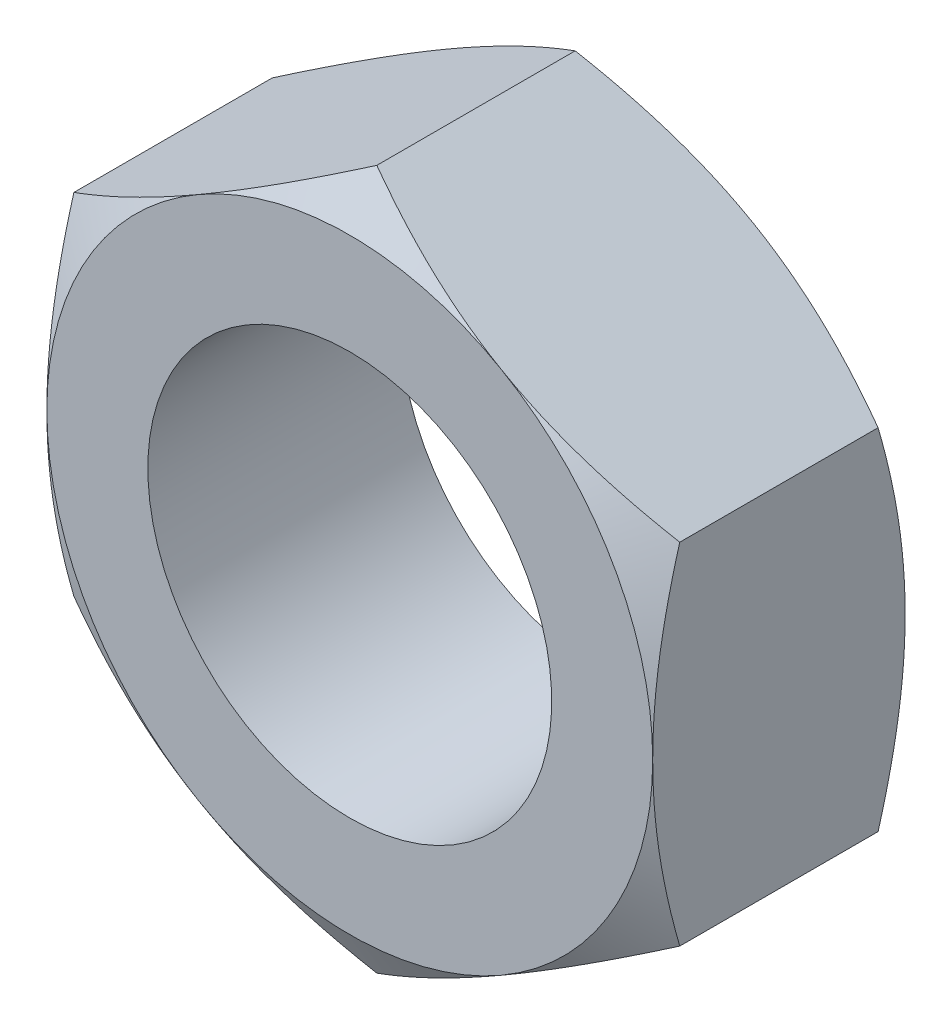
ISO-10303-21;
HEADER;
FILE_DESCRIPTION(('STEP AP214'),'2;1');
FILE_NAME('part.step','',(''),(''),'','','');
FILE_SCHEMA(('AUTOMOTIVE_DESIGN { 1 0 10303 214 1 1 1 1 }'));
ENDSEC;
DATA;
#1=APPLICATION_CONTEXT('core data for automotive mechanical design processes');
#2=APPLICATION_PROTOCOL_DEFINITION('international standard','automotive_design',2000,#1);
#3=PRODUCT_CONTEXT('',#1,'mechanical');
#4=PRODUCT('Part','Part','',(#3));
#5=PRODUCT_RELATED_PRODUCT_CATEGORY('part','',(#4));
#6=PRODUCT_DEFINITION_FORMATION('','',#4);
#7=PRODUCT_DEFINITION_CONTEXT('part definition',#1,'design');
#8=PRODUCT_DEFINITION('design','',#6,#7);
#9=PRODUCT_DEFINITION_SHAPE('','',#8);
#10=(LENGTH_UNIT() NAMED_UNIT(*) SI_UNIT(.MILLI.,.METRE.));
#11=(NAMED_UNIT(*) PLANE_ANGLE_UNIT() SI_UNIT($,.RADIAN.));
#12=(NAMED_UNIT(*) SI_UNIT($,.STERADIAN.) SOLID_ANGLE_UNIT());
#13=UNCERTAINTY_MEASURE_WITH_UNIT(LENGTH_MEASURE(1.E-05),#10,'distance_accuracy_value','');
#14=(GEOMETRIC_REPRESENTATION_CONTEXT(3) GLOBAL_UNCERTAINTY_ASSIGNED_CONTEXT((#13)) GLOBAL_UNIT_ASSIGNED_CONTEXT((#10,
#11,#12)) REPRESENTATION_CONTEXT('',''));
#15=CARTESIAN_POINT('',(0.,0.,0.));
#16=DIRECTION('',(0.,0.,1.));
#17=DIRECTION('',(1.,0.,0.));
#18=AXIS2_PLACEMENT_3D('',#15,#16,#17);
#19=CARTESIAN_POINT('',(-12.,-6.92820323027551,13.));
#20=DIRECTION('',(-1.,0.,0.));
#21=DIRECTION('',(0.,0.,1.));
#22=AXIS2_PLACEMENT_3D('',#19,#20,#21);
#23=PLANE('',#22);
#24=CARTESIAN_POINT('',(-12.,-18.6518617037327,5.87663888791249));
#25=CARTESIAN_POINT('',(-12.,-18.3896412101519,5.7493223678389));
#26=CARTESIAN_POINT('',(-12.,-18.1271141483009,5.62263755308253));
#27=CARTESIAN_POINT('',(-12.,-17.6013829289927,5.3706743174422));
#28=CARTESIAN_POINT('',(-12.,-17.3381787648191,5.24539591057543));
#29=CARTESIAN_POINT('',(-12.,-16.5473851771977,4.87185203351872));
#30=CARTESIAN_POINT('',(-12.,-16.0186915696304,4.62591535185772));
#31=CARTESIAN_POINT('',(-12.,-14.9549231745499,4.14041606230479));
#32=CARTESIAN_POINT('',(-12.,-14.4198293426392,3.90089508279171));
#33=CARTESIAN_POINT('',(-12.,-13.3454010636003,3.43159507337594));
#34=CARTESIAN_POINT('',(-12.,-12.8060668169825,3.20181558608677));
#35=CARTESIAN_POINT('',(-12.,-11.7047057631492,2.74731433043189));
#36=CARTESIAN_POINT('',(-12.,-11.1425105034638,2.52299864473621));
#37=CARTESIAN_POINT('',(-12.,-10.0115541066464,2.09124232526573));
#38=CARTESIAN_POINT('',(-12.,-9.44279224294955,1.88380357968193));
#39=CARTESIAN_POINT('',(-12.,-8.29886743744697,1.49121945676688));
#40=CARTESIAN_POINT('',(-12.,-7.7237199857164,1.30602930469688));
#41=CARTESIAN_POINT('',(-12.,-6.56512029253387,0.963846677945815));
#42=CARTESIAN_POINT('',(-12.,-5.98167071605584,0.806845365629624));
#43=CARTESIAN_POINT('',(-12.,-5.101786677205,0.598577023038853));
#44=CARTESIAN_POINT('',(-12.,-4.80852274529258,0.53383467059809));
#45=CARTESIAN_POINT('',(-12.,-4.21998323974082,0.414194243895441));
#46=CARTESIAN_POINT('',(-12.,-3.92470770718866,0.359295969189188));
#47=CARTESIAN_POINT('',(-12.,-3.33234535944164,0.260310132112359));
#48=CARTESIAN_POINT('',(-12.,-3.03525857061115,0.216222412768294));
#49=CARTESIAN_POINT('',(-12.,-2.43958530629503,0.139735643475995));
#50=CARTESIAN_POINT('',(-12.,-2.14099888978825,0.107336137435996));
#51=CARTESIAN_POINT('',(-12.,-1.5466600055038,0.0552779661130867));
#52=CARTESIAN_POINT('',(-12.,-1.25092178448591,0.0354576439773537));
#53=CARTESIAN_POINT('',(-12.,-0.658872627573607,0.00834350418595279));
#54=CARTESIAN_POINT('',(-12.,-0.362561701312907,0.00104947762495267));
#55=CARTESIAN_POINT('',(-12.,0.230103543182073,-0.000838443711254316));
#56=CARTESIAN_POINT('',(-12.,0.5264578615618,0.00456770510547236));
#57=CARTESIAN_POINT('',(-12.,1.11867376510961,0.02794777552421));
#58=CARTESIAN_POINT('',(-12.,1.41453532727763,0.0459222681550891));
#59=CARTESIAN_POINT('',(-12.,2.12432603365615,0.103738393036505));
#60=CARTESIAN_POINT('',(-12.,2.53778366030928,0.149473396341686));
#61=CARTESIAN_POINT('',(-12.,3.36166029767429,0.263007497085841));
#62=CARTESIAN_POINT('',(-12.,3.7720788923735,0.330809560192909));
#63=CARTESIAN_POINT('',(-12.,4.58947634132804,0.48606588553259));
#64=CARTESIAN_POINT('',(-12.,4.99645227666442,0.573535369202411));
#65=CARTESIAN_POINT('',(-12.,5.80633621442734,0.765454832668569));
#66=CARTESIAN_POINT('',(-12.,6.20924427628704,0.869904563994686));
#67=CARTESIAN_POINT('',(-12.,7.01985962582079,1.0957108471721));
#68=CARTESIAN_POINT('',(-12.,7.4274764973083,1.21738973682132));
#69=CARTESIAN_POINT('',(-12.,8.23869539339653,1.47339834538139));
#70=CARTESIAN_POINT('',(-12.,8.64229739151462,1.6077281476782));
#71=CARTESIAN_POINT('',(-12.,9.44568444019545,1.886898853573));
#72=CARTESIAN_POINT('',(-12.,9.84547069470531,2.03173630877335));
#73=CARTESIAN_POINT('',(-12.,10.6417254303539,2.33021066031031));
#74=CARTESIAN_POINT('',(-12.,11.0381939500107,2.48384745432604));
#75=CARTESIAN_POINT('',(-12.,11.9721435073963,2.85579302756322));
#76=CARTESIAN_POINT('',(-12.,12.5083621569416,3.07726682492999));
#77=CARTESIAN_POINT('',(-12.,13.5762381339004,3.53098219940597));
#78=CARTESIAN_POINT('',(-12.,14.1078951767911,3.76322444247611));
#79=CARTESIAN_POINT('',(-12.,15.167494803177,4.23632525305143));
#80=CARTESIAN_POINT('',(-12.,15.6954365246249,4.47718574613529));
#81=CARTESIAN_POINT('',(-12.,16.7481043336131,4.96578792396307));
#82=CARTESIAN_POINT('',(-12.,17.2728304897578,5.21352946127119));
#83=CARTESIAN_POINT('',(-12.,18.3201744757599,5.71488471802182));
#84=CARTESIAN_POINT('',(-12.,18.8427893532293,5.9685045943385));
#85=CARTESIAN_POINT('',(-12.,19.8857580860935,6.48035069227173));
#86=CARTESIAN_POINT('',(-12.,20.4061119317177,6.73857693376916));
#87=CARTESIAN_POINT('',(-12.,21.4448380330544,7.25881355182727));
#88=CARTESIAN_POINT('',(-12.,21.9632105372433,7.52082343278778));
#89=CARTESIAN_POINT('',(-12.,22.9983271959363,8.0480419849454));
#90=CARTESIAN_POINT('',(-12.,23.5150713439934,8.31325066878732));
#91=CARTESIAN_POINT('',(-12.,24.9767380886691,9.06823761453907));
#92=CARTESIAN_POINT('',(-12.,25.9200240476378,9.56118437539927));
#93=CARTESIAN_POINT('',(-12.,27.803073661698,10.5538247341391));
#94=CARTESIAN_POINT('',(-12.,28.7428371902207,11.0535185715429));
#95=CARTESIAN_POINT('',(-12.,30.6172479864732,12.0568154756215));
#96=CARTESIAN_POINT('',(-12.,31.5519021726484,12.5604056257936));
#97=CARTESIAN_POINT('',(-12.,32.9522210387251,13.3187952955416));
#98=CARTESIAN_POINT('',(-12.,33.418704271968,13.5720856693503));
#99=CARTESIAN_POINT('',(-12.,34.3511792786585,14.0795677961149));
#100=CARTESIAN_POINT('',(-12.,34.8171710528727,14.3337595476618));
#101=CARTESIAN_POINT('',(-12.,35.2829449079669,14.588350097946));
#102=B_SPLINE_CURVE_WITH_KNOTS('',3,(#24,#25,#26,#27,#28,#29,#30,#31,#32,#33,#34,#35,#36,#37,
#38,#39,#40,#41,#42,#43,#44,#45,#46,#47,#48,#49,#50,#51,#52,#53,#54,#55,#56,#57,#58,#59,#60,#61,
#62,#63,#64,#65,#66,#67,#68,#69,#70,#71,#72,#73,#74,#75,#76,#77,#78,#79,#80,#81,#82,#83,#84,#85,
#86,#87,#88,#89,#90,#91,#92,#93,#94,#95,#96,#97,#98,#99,#100,#101),.UNSPECIFIED.,.F.,.F.,(4,2,2,
2,2,2,2,2,2,2,2,2,2,2,2,2,2,2,2,2,2,2,2,2,2,2,2,2,2,2,2,2,2,2,2,2,2,2,4),(0.,0.874482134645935,
1.74897297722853,3.4982112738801,5.25690259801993,7.0155112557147,8.83118688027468,
10.6470653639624,12.4592259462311,14.2708173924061,15.1716549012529,16.0724740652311,
16.9732801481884,17.8740510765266,18.7629982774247,19.6519306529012,20.5408660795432,
21.4298418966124,22.6770910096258,23.9245078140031,25.1728933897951,26.4212606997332,
27.6971876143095,28.9731229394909,30.2486414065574,31.5241450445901,33.264453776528,
35.004870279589,36.7456781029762,38.4864486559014,40.2291331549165,41.9718251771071,
43.7142909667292,45.4567636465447,48.6496933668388,51.8427367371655,55.0277873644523,
56.620226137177,58.2126624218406),.UNSPECIFIED.);
#103=CARTESIAN_POINT('',(-12.,-6.92820323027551,1.07179676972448));
#104=VERTEX_POINT('',#103);
#105=CARTESIAN_POINT('',(-12.,0.,0.));
#106=VERTEX_POINT('',#105);
#107=EDGE_CURVE('E137',#104,#106,#102,.T.);
#108=ORIENTED_EDGE('',*,*,#107,.F.);
#109=DIRECTION('',(0.,0.,-1.));
#110=VECTOR('',#109,1.);
#111=CARTESIAN_POINT('',(-12.,-6.92820323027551,13.));
#112=LINE('',#111,#110);
#113=CARTESIAN_POINT('',(-12.,-6.92820323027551,8.92820323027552));
#114=VERTEX_POINT('',#113);
#115=EDGE_CURVE('E266',#114,#104,#112,.T.);
#116=ORIENTED_EDGE('',*,*,#115,.F.);
#117=CARTESIAN_POINT('',(-12.,-18.6518617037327,4.1233611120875));
#118=CARTESIAN_POINT('',(-12.,-18.3896412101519,4.25067763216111));
#119=CARTESIAN_POINT('',(-12.,-18.1271141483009,4.37736244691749));
#120=CARTESIAN_POINT('',(-12.,-17.6013829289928,4.62932568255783));
#121=CARTESIAN_POINT('',(-12.,-17.3381787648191,4.7546040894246));
#122=CARTESIAN_POINT('',(-12.,-16.5473851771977,5.12814796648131));
#123=CARTESIAN_POINT('',(-12.,-16.0186915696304,5.3740846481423));
#124=CARTESIAN_POINT('',(-12.,-14.9549231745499,5.85958393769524));
#125=CARTESIAN_POINT('',(-12.,-14.4198293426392,6.09910491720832));
#126=CARTESIAN_POINT('',(-12.,-13.3454010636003,6.56840492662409));
#127=CARTESIAN_POINT('',(-12.,-12.8060668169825,6.79818441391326));
#128=CARTESIAN_POINT('',(-12.,-11.7047057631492,7.25268566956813));
#129=CARTESIAN_POINT('',(-12.,-11.1425105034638,7.47700135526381));
#130=CARTESIAN_POINT('',(-12.,-10.0115541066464,7.9087576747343));
#131=CARTESIAN_POINT('',(-12.,-9.44279224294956,8.1161964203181));
#132=CARTESIAN_POINT('',(-12.,-8.29886743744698,8.50878054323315));
#133=CARTESIAN_POINT('',(-12.,-7.72371998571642,8.69397069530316));
#134=CARTESIAN_POINT('',(-12.,-6.56512029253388,9.0361533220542));
#135=CARTESIAN_POINT('',(-12.,-5.98167071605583,9.19315463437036));
#136=CARTESIAN_POINT('',(-12.,-5.101786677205,9.40142297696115));
#137=CARTESIAN_POINT('',(-12.,-4.80852274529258,9.46616532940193));
#138=CARTESIAN_POINT('',(-12.,-4.21998323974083,9.5858057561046));
#139=CARTESIAN_POINT('',(-12.,-3.92470770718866,9.64070403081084));
#140=CARTESIAN_POINT('',(-12.,-3.33234535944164,9.73968986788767));
#141=CARTESIAN_POINT('',(-12.,-3.03525857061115,9.78377758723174));
#142=CARTESIAN_POINT('',(-12.,-2.43958530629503,9.86026435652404));
#143=CARTESIAN_POINT('',(-12.,-2.14099888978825,9.89266386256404));
#144=CARTESIAN_POINT('',(-12.,-1.54666000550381,9.94472203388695));
#145=CARTESIAN_POINT('',(-12.,-1.25092178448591,9.96454235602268));
#146=CARTESIAN_POINT('',(-12.,-0.65887262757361,9.99165649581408));
#147=CARTESIAN_POINT('',(-12.,-0.36256170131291,9.99895052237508));
#148=CARTESIAN_POINT('',(-12.,0.230103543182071,10.0008384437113));
#149=CARTESIAN_POINT('',(-12.,0.526457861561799,9.99543229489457));
#150=CARTESIAN_POINT('',(-12.,1.11867376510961,9.97205222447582));
#151=CARTESIAN_POINT('',(-12.,1.41453532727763,9.95407773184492));
#152=CARTESIAN_POINT('',(-12.,2.12432603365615,9.89626160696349));
#153=CARTESIAN_POINT('',(-12.,2.53778366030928,9.85052660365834));
#154=CARTESIAN_POINT('',(-12.,3.3616602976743,9.7369925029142));
#155=CARTESIAN_POINT('',(-12.,3.77207889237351,9.66919043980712));
#156=CARTESIAN_POINT('',(-12.,4.58947634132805,9.51393411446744));
#157=CARTESIAN_POINT('',(-12.,4.99645227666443,9.42646463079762));
#158=CARTESIAN_POINT('',(-12.,5.80633621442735,9.23454516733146));
#159=CARTESIAN_POINT('',(-12.,6.20924427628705,9.13009543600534));
#160=CARTESIAN_POINT('',(-12.,7.0198596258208,8.90428915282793));
#161=CARTESIAN_POINT('',(-12.,7.42747649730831,8.78261026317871));
#162=CARTESIAN_POINT('',(-12.,8.23869539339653,8.52660165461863));
#163=CARTESIAN_POINT('',(-12.,8.64229739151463,8.39227185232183));
#164=CARTESIAN_POINT('',(-12.,9.44568444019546,8.11310114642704));
#165=CARTESIAN_POINT('',(-12.,9.84547069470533,7.96826369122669));
#166=CARTESIAN_POINT('',(-12.,10.6417254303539,7.66978933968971));
#167=CARTESIAN_POINT('',(-12.,11.0381939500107,7.51615254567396));
#168=CARTESIAN_POINT('',(-12.,11.9721435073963,7.14420697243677));
#169=CARTESIAN_POINT('',(-12.,12.5083621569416,6.92273317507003));
#170=CARTESIAN_POINT('',(-12.,13.5762381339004,6.46901780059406));
#171=CARTESIAN_POINT('',(-12.,14.1078951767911,6.23677555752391));
#172=CARTESIAN_POINT('',(-12.,15.1674948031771,5.76367474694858));
#173=CARTESIAN_POINT('',(-12.,15.6954365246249,5.52281425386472));
#174=CARTESIAN_POINT('',(-12.,16.7481043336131,5.03421207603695));
#175=CARTESIAN_POINT('',(-12.,17.2728304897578,4.78647053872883));
#176=CARTESIAN_POINT('',(-12.,18.3201744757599,4.2851152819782));
#177=CARTESIAN_POINT('',(-12.,18.8427893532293,4.03149540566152));
#178=CARTESIAN_POINT('',(-12.,19.8857580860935,3.51964930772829));
#179=CARTESIAN_POINT('',(-12.,20.4061119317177,3.26142306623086));
#180=CARTESIAN_POINT('',(-12.,21.4448380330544,2.74118644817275));
#181=CARTESIAN_POINT('',(-12.,21.9632105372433,2.47917656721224));
#182=CARTESIAN_POINT('',(-12.,22.9983271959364,1.95195801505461));
#183=CARTESIAN_POINT('',(-12.,23.5150713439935,1.6867493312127));
#184=CARTESIAN_POINT('',(-12.,24.9767380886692,0.931762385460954));
#185=CARTESIAN_POINT('',(-12.,25.9200240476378,0.438815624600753));
#186=CARTESIAN_POINT('',(-12.,27.803073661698,-0.553824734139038));
#187=CARTESIAN_POINT('',(-12.,28.7428371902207,-1.05351857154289));
#188=CARTESIAN_POINT('',(-12.,30.6172479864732,-2.05681547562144));
#189=CARTESIAN_POINT('',(-12.,31.5519021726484,-2.56040562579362));
#190=CARTESIAN_POINT('',(-12.,32.9522210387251,-3.31879529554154));
#191=CARTESIAN_POINT('',(-12.,33.418704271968,-3.57208566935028));
#192=CARTESIAN_POINT('',(-12.,34.3511792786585,-4.07956779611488));
#193=CARTESIAN_POINT('',(-12.,34.8171710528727,-4.33375954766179));
#194=CARTESIAN_POINT('',(-12.,35.2829449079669,-4.588350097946));
#195=B_SPLINE_CURVE_WITH_KNOTS('',3,(#117,#118,#119,#120,#121,#122,#123,#124,#125,#126,#127,
#128,#129,#130,#131,#132,#133,#134,#135,#136,#137,#138,#139,#140,#141,#142,#143,#144,#145,#146,
#147,#148,#149,#150,#151,#152,#153,#154,#155,#156,#157,#158,#159,#160,#161,#162,#163,#164,#165,
#166,#167,#168,#169,#170,#171,#172,#173,#174,#175,#176,#177,#178,#179,#180,#181,#182,#183,#184,
#185,#186,#187,#188,#189,#190,#191,#192,#193,#194),.UNSPECIFIED.,.F.,.F.,(4,2,2,2,2,2,2,2,2,2,2,
2,2,2,2,2,2,2,2,2,2,2,2,2,2,2,2,2,2,2,2,2,2,2,2,2,2,2,4),(0.,0.874482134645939,1.74897297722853,
3.49821127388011,5.25690259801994,7.0155112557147,8.83118688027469,10.6470653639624,
12.4592259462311,14.2708173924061,15.1716549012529,16.0724740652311,16.9732801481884,
17.8740510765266,18.7629982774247,19.6519306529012,20.5408660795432,21.4298418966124,
22.6770910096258,23.9245078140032,25.1728933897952,26.4212606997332,27.6971876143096,
28.9731229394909,30.2486414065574,31.5241450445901,33.264453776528,35.004870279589,
36.7456781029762,38.4864486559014,40.2291331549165,41.9718251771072,43.7142909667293,
45.4567636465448,48.6496933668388,51.8427367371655,55.0277873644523,56.620226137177,
58.2126624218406),.UNSPECIFIED.);
#196=CARTESIAN_POINT('',(-12.,0.,10.));
#197=VERTEX_POINT('',#196);
#198=EDGE_CURVE('E220',#197,#114,#195,.F.);
#199=ORIENTED_EDGE('',*,*,#198,.F.);
#200=CARTESIAN_POINT('',(-12.,6.92820323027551,8.92820323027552));
#201=VERTEX_POINT('',#200);
#202=EDGE_CURVE('E206',#201,#197,#195,.F.);
#203=ORIENTED_EDGE('',*,*,#202,.F.);
#204=DIRECTION('',(0.,0.,-1.));
#205=VECTOR('',#204,1.);
#206=CARTESIAN_POINT('',(-12.,6.92820323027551,13.));
#207=LINE('',#206,#205);
#208=CARTESIAN_POINT('',(-12.,6.92820323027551,1.07179676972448));
#209=VERTEX_POINT('',#208);
#210=EDGE_CURVE('E260',#201,#209,#207,.T.);
#211=ORIENTED_EDGE('',*,*,#210,.T.);
#212=EDGE_CURVE('E115',#106,#209,#102,.T.);
#213=ORIENTED_EDGE('',*,*,#212,.F.);
#214=EDGE_LOOP('',(#108,#116,#199,#203,#211,#213));
#215=FACE_BOUND('',#214,.T.);
#216=ADVANCED_FACE('F14',(#215),#23,.T.);
#217=CARTESIAN_POINT('',(-12.,-6.92820323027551,13.));
#218=DIRECTION('',(0.5,0.86602540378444,0.));
#219=DIRECTION('',(-0.86602540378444,0.5,0.));
#220=AXIS2_PLACEMENT_3D('',#217,#218,#219);
#221=PLANE('',#220);
#222=ORIENTED_EDGE('',*,*,#115,.T.);
#223=CARTESIAN_POINT('',(-12.0002,-6.92808776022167,1.07186343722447));
#224=CARTESIAN_POINT('',(-11.7364142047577,-7.08038456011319,0.983949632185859));
#225=CARTESIAN_POINT('',(-11.4716448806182,-7.23324920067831,0.900025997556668));
#226=CARTESIAN_POINT('',(-10.9399829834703,-7.54020434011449,0.741266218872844));
#227=CARTESIAN_POINT('',(-10.6730897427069,-7.69429522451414,0.666433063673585));
#228=CARTESIAN_POINT('',(-9.86810959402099,-8.15905073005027,0.457017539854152));
#229=CARTESIAN_POINT('',(-9.3268449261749,-8.47155003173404,0.337903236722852));
#230=CARTESIAN_POINT('',(-8.516867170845,-8.93919090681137,0.198231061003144));
#231=CARTESIAN_POINT('',(-8.25057389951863,-9.09293539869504,0.158443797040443));
#232=CARTESIAN_POINT('',(-7.71675440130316,-9.40113622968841,0.0917233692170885));
#233=CARTESIAN_POINT('',(-7.44922815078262,-9.55559258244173,0.0647904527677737));
#234=CARTESIAN_POINT('',(-6.91372963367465,-9.86476279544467,0.0244685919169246));
#235=CARTESIAN_POINT('',(-6.64575827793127,-10.0194761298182,0.0110635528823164));
#236=CARTESIAN_POINT('',(-6.10956726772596,-10.3290461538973,-0.00191690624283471));
#237=CARTESIAN_POINT('',(-5.84134762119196,-10.4839028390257,-0.00149275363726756));
#238=CARTESIAN_POINT('',(-5.33991062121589,-10.7734076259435,0.012220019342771));
#239=CARTESIAN_POINT('',(-5.10665750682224,-10.908076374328,0.0238359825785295));
#240=CARTESIAN_POINT('',(-4.64068775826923,-11.1771041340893,0.0573080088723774));
#241=CARTESIAN_POINT('',(-4.40797116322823,-11.3114631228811,0.0791647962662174));
#242=CARTESIAN_POINT('',(-3.94320092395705,-11.5797983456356,0.132737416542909));
#243=CARTESIAN_POINT('',(-3.711147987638,-11.7137741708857,0.164461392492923));
#244=CARTESIAN_POINT('',(-3.24813003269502,-11.9810977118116,0.237211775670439));
#245=CARTESIAN_POINT('',(-3.01716508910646,-12.1144453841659,0.278238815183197));
#246=CARTESIAN_POINT('',(-2.31605804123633,-12.5192297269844,0.416311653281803));
#247=CARTESIAN_POINT('',(-1.84794625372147,-12.789494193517,0.527124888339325));
#248=CARTESIAN_POINT('',(-0.91870289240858,-13.3259930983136,0.77862576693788));
#249=CARTESIAN_POINT('',(-0.457559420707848,-13.5922344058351,0.919254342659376));
#250=CARTESIAN_POINT('',(0.000199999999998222,-13.8565219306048,1.07186343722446));
#251=B_SPLINE_CURVE_WITH_KNOTS('',3,(#223,#224,#225,#226,#227,#228,#229,#230,#231,#232,#233,
#234,#235,#236,#237,#238,#239,#240,#241,#242,#243,#244,#245,#246,#247,#248,#249,#250),
.UNSPECIFIED.,.F.,.F.,(4,2,2,2,2,2,2,2,2,2,2,2,2,4),(0.,0.951004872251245,1.90232158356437,
3.80900466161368,4.7389455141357,5.66890426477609,6.59775529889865,7.5265776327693,
8.33514643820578,9.14377244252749,9.95306755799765,10.7624176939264,12.4167102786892,
14.0677556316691),.UNSPECIFIED.);
#252=CARTESIAN_POINT('',(-6.,-10.3923048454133,0.));
#253=VERTEX_POINT('',#252);
#254=EDGE_CURVE('E138',#104,#253,#251,.T.);
#255=ORIENTED_EDGE('',*,*,#254,.T.);
#256=CARTESIAN_POINT('',(0.,-13.856406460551,1.07179676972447));
#257=VERTEX_POINT('',#256);
#258=EDGE_CURVE('E123',#253,#257,#251,.T.);
#259=ORIENTED_EDGE('',*,*,#258,.T.);
#260=DIRECTION('',(0.,0.,-1.));
#261=VECTOR('',#260,1.);
#262=CARTESIAN_POINT('',(0.,-13.856406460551,13.));
#263=LINE('',#262,#261);
#264=CARTESIAN_POINT('',(0.,-13.856406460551,8.92820323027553));
#265=VERTEX_POINT('',#264);
#266=EDGE_CURVE('E136',#265,#257,#263,.T.);
#267=ORIENTED_EDGE('',*,*,#266,.F.);
#268=CARTESIAN_POINT('',(0.000200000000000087,-13.8565219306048,8.92813656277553));
#269=CARTESIAN_POINT('',(-0.26358579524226,-13.7042251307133,9.01605036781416));
#270=CARTESIAN_POINT('',(-0.528355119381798,-13.5513604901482,9.09997400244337));
#271=CARTESIAN_POINT('',(-1.06001701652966,-13.244405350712,9.2587337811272));
#272=CARTESIAN_POINT('',(-1.32691025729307,-13.0903144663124,9.33356693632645));
#273=CARTESIAN_POINT('',(-2.13189040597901,-12.6255589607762,9.54298246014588));
#274=CARTESIAN_POINT('',(-2.6731550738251,-12.3130596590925,9.66209676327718));
#275=CARTESIAN_POINT('',(-3.48313282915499,-11.8454187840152,9.80176893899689));
#276=CARTESIAN_POINT('',(-3.74942610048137,-11.6916742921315,9.84155620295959));
#277=CARTESIAN_POINT('',(-4.28324559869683,-11.3834734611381,9.90827663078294));
#278=CARTESIAN_POINT('',(-4.55077184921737,-11.2290171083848,9.93520954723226));
#279=CARTESIAN_POINT('',(-5.08627036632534,-10.9198468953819,9.97553140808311));
#280=CARTESIAN_POINT('',(-5.35424172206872,-10.7651335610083,9.98893644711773));
#281=CARTESIAN_POINT('',(-5.89043273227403,-10.4555635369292,10.0019169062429));
#282=CARTESIAN_POINT('',(-6.15865237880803,-10.3007068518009,10.0014927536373));
#283=CARTESIAN_POINT('',(-6.6600893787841,-10.011202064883,9.98777998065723));
#284=CARTESIAN_POINT('',(-6.89334249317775,-9.87653331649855,9.97616401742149));
#285=CARTESIAN_POINT('',(-7.35931224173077,-9.60750555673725,9.94269199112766));
#286=CARTESIAN_POINT('',(-7.59202883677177,-9.47314656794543,9.92083520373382));
#287=CARTESIAN_POINT('',(-8.05679907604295,-9.20481134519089,9.86726258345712));
#288=CARTESIAN_POINT('',(-8.28885201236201,-9.07083551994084,9.83553860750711));
#289=CARTESIAN_POINT('',(-8.75186996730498,-8.80351197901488,9.76278822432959));
#290=CARTESIAN_POINT('',(-8.98283491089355,-8.67016430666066,9.72176118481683));
#291=CARTESIAN_POINT('',(-9.68394195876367,-8.2653799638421,9.58368834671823));
#292=CARTESIAN_POINT('',(-10.1520537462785,-7.99511549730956,9.4728751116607));
#293=CARTESIAN_POINT('',(-11.0812971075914,-7.45861659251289,9.22137423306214));
#294=CARTESIAN_POINT('',(-11.5424405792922,-7.19237528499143,9.08074565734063));
#295=CARTESIAN_POINT('',(-12.0002,-6.92808776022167,8.92813656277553));
#296=B_SPLINE_CURVE_WITH_KNOTS('',3,(#268,#269,#270,#271,#272,#273,#274,#275,#276,#277,#278,
#279,#280,#281,#282,#283,#284,#285,#286,#287,#288,#289,#290,#291,#292,#293,#294,#295),
.UNSPECIFIED.,.F.,.F.,(4,2,2,2,2,2,2,2,2,2,2,2,2,4),(0.,0.951004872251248,1.90232158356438,
3.80900466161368,4.7389455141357,5.66890426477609,6.59775529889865,7.5265776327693,
8.33514643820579,9.14377244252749,9.95306755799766,10.7624176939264,12.4167102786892,
14.0677556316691),.UNSPECIFIED.);
#297=CARTESIAN_POINT('',(-6.,-10.3923048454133,10.));
#298=VERTEX_POINT('',#297);
#299=EDGE_CURVE('E257',#265,#298,#296,.T.);
#300=ORIENTED_EDGE('',*,*,#299,.T.);
#301=EDGE_CURVE('E263',#298,#114,#296,.T.);
#302=ORIENTED_EDGE('',*,*,#301,.T.);
#303=EDGE_LOOP('',(#222,#255,#259,#267,#300,#302));
#304=FACE_BOUND('',#303,.T.);
#305=ADVANCED_FACE('F16',(#304),#221,.F.);
#306=CARTESIAN_POINT('',(12.,-6.9282032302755,13.));
#307=DIRECTION('',(0.5,-0.866025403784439,0.));
#308=DIRECTION('',(0.86602540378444,0.5,0.));
#309=AXIS2_PLACEMENT_3D('',#306,#307,#308);
#310=PLANE('',#309);
#311=CARTESIAN_POINT('',(12.0002,-6.92808776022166,1.07186343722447));
#312=CARTESIAN_POINT('',(11.7364142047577,-7.08038456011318,0.983949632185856));
#313=CARTESIAN_POINT('',(11.4716448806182,-7.2332492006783,0.900025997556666));
#314=CARTESIAN_POINT('',(10.9399829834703,-7.54020434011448,0.741266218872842));
#315=CARTESIAN_POINT('',(10.6730897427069,-7.69429522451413,0.666433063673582));
#316=CARTESIAN_POINT('',(9.86810959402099,-8.15905073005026,0.457017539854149));
#317=CARTESIAN_POINT('',(9.3268449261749,-8.47155003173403,0.337903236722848));
#318=CARTESIAN_POINT('',(8.516867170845,-8.93919090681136,0.198231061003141));
#319=CARTESIAN_POINT('',(8.25057389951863,-9.09293539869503,0.158443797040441));
#320=CARTESIAN_POINT('',(7.71675440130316,-9.4011362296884,0.0917233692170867));
#321=CARTESIAN_POINT('',(7.44922815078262,-9.55559258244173,0.0647904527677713));
#322=CARTESIAN_POINT('',(6.91372963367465,-9.86476279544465,0.0244685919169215));
#323=CARTESIAN_POINT('',(6.64575827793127,-10.0194761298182,0.0110635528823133));
#324=CARTESIAN_POINT('',(6.10956726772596,-10.3290461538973,-0.00191690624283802));
#325=CARTESIAN_POINT('',(5.84134762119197,-10.4839028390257,-0.00149275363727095));
#326=CARTESIAN_POINT('',(5.3399106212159,-10.7734076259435,0.0122200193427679));
#327=CARTESIAN_POINT('',(5.10665750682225,-10.908076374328,0.0238359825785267));
#328=CARTESIAN_POINT('',(4.64068775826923,-11.1771041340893,0.0573080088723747));
#329=CARTESIAN_POINT('',(4.40797116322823,-11.3114631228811,0.0791647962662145));
#330=CARTESIAN_POINT('',(3.94320092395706,-11.5797983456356,0.132737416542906));
#331=CARTESIAN_POINT('',(3.711147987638,-11.7137741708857,0.164461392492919));
#332=CARTESIAN_POINT('',(3.24813003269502,-11.9810977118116,0.237211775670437));
#333=CARTESIAN_POINT('',(3.01716508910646,-12.1144453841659,0.278238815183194));
#334=CARTESIAN_POINT('',(2.31605804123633,-12.5192297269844,0.416311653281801));
#335=CARTESIAN_POINT('',(1.84794625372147,-12.789494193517,0.527124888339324));
#336=CARTESIAN_POINT('',(0.918702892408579,-13.3259930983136,0.778625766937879));
#337=CARTESIAN_POINT('',(0.457559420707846,-13.5922344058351,0.919254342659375));
#338=CARTESIAN_POINT('',(-0.000199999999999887,-13.8565219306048,1.07186343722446));
#339=B_SPLINE_CURVE_WITH_KNOTS('',3,(#311,#312,#313,#314,#315,#316,#317,#318,#319,#320,#321,
#322,#323,#324,#325,#326,#327,#328,#329,#330,#331,#332,#333,#334,#335,#336,#337,#338),
.UNSPECIFIED.,.F.,.F.,(4,2,2,2,2,2,2,2,2,2,2,2,2,4),(0.,0.951004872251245,1.90232158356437,
3.80900466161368,4.7389455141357,5.66890426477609,6.59775529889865,7.5265776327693,
8.33514643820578,9.14377244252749,9.95306755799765,10.7624176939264,12.4167102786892,
14.0677556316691),.UNSPECIFIED.);
#340=CARTESIAN_POINT('',(12.,-6.9282032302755,1.07179676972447));
#341=VERTEX_POINT('',#340);
#342=CARTESIAN_POINT('',(6.,-10.3923048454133,0.));
#343=VERTEX_POINT('',#342);
#344=EDGE_CURVE('E104',#341,#343,#339,.T.);
#345=ORIENTED_EDGE('',*,*,#344,.F.);
#346=DIRECTION('',(0.,0.,-1.));
#347=VECTOR('',#346,1.);
#348=CARTESIAN_POINT('',(12.,-6.9282032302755,13.));
#349=LINE('',#348,#347);
#350=CARTESIAN_POINT('',(12.,-6.9282032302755,8.92820323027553));
#351=VERTEX_POINT('',#350);
#352=EDGE_CURVE('E294',#351,#341,#349,.T.);
#353=ORIENTED_EDGE('',*,*,#352,.F.);
#354=CARTESIAN_POINT('',(-0.000199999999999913,-13.8565219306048,8.92813656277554));
#355=CARTESIAN_POINT('',(0.263585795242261,-13.7042251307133,9.01605036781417));
#356=CARTESIAN_POINT('',(0.528355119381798,-13.5513604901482,9.09997400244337));
#357=CARTESIAN_POINT('',(1.06001701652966,-13.244405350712,9.2587337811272));
#358=CARTESIAN_POINT('',(1.32691025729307,-13.0903144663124,9.33356693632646));
#359=CARTESIAN_POINT('',(2.131890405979,-12.6255589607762,9.54298246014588));
#360=CARTESIAN_POINT('',(2.6731550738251,-12.3130596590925,9.66209676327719));
#361=CARTESIAN_POINT('',(3.48313282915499,-11.8454187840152,9.80176893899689));
#362=CARTESIAN_POINT('',(3.74942610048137,-11.6916742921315,9.84155620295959));
#363=CARTESIAN_POINT('',(4.28324559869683,-11.3834734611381,9.90827663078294));
#364=CARTESIAN_POINT('',(4.55077184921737,-11.2290171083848,9.93520954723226));
#365=CARTESIAN_POINT('',(5.08627036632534,-10.9198468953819,9.97553140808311));
#366=CARTESIAN_POINT('',(5.35424172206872,-10.7651335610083,9.98893644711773));
#367=CARTESIAN_POINT('',(5.89043273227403,-10.4555635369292,10.0019169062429));
#368=CARTESIAN_POINT('',(6.15865237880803,-10.3007068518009,10.0014927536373));
#369=CARTESIAN_POINT('',(6.6600893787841,-10.011202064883,9.98777998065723));
#370=CARTESIAN_POINT('',(6.89334249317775,-9.87653331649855,9.9761640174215));
#371=CARTESIAN_POINT('',(7.35931224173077,-9.60750555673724,9.94269199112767));
#372=CARTESIAN_POINT('',(7.59202883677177,-9.47314656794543,9.92083520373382));
#373=CARTESIAN_POINT('',(8.05679907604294,-9.20481134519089,9.86726258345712));
#374=CARTESIAN_POINT('',(8.288852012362,-9.07083551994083,9.83553860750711));
#375=CARTESIAN_POINT('',(8.75186996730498,-8.80351197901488,9.76278822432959));
#376=CARTESIAN_POINT('',(8.98283491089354,-8.67016430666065,9.72176118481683));
#377=CARTESIAN_POINT('',(9.68394195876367,-8.26537996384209,9.58368834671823));
#378=CARTESIAN_POINT('',(10.1520537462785,-7.99511549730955,9.47287511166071));
#379=CARTESIAN_POINT('',(11.0812971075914,-7.45861659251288,9.22137423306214));
#380=CARTESIAN_POINT('',(11.5424405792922,-7.19237528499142,9.08074565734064));
#381=CARTESIAN_POINT('',(12.0002,-6.92808776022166,8.92813656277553));
#382=B_SPLINE_CURVE_WITH_KNOTS('',3,(#354,#355,#356,#357,#358,#359,#360,#361,#362,#363,#364,
#365,#366,#367,#368,#369,#370,#371,#372,#373,#374,#375,#376,#377,#378,#379,#380,#381),
.UNSPECIFIED.,.F.,.F.,(4,2,2,2,2,2,2,2,2,2,2,2,2,4),(0.,0.951004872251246,1.90232158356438,
3.80900466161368,4.7389455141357,5.66890426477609,6.59775529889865,7.5265776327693,
8.33514643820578,9.14377244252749,9.95306755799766,10.7624176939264,12.4167102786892,
14.0677556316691),.UNSPECIFIED.);
#383=CARTESIAN_POINT('',(6.,-10.3923048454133,10.));
#384=VERTEX_POINT('',#383);
#385=EDGE_CURVE('E308',#384,#351,#382,.T.);
#386=ORIENTED_EDGE('',*,*,#385,.F.);
#387=EDGE_CURVE('E284',#265,#384,#382,.T.);
#388=ORIENTED_EDGE('',*,*,#387,.F.);
#389=ORIENTED_EDGE('',*,*,#266,.T.);
#390=EDGE_CURVE('E117',#343,#257,#339,.T.);
#391=ORIENTED_EDGE('',*,*,#390,.F.);
#392=EDGE_LOOP('',(#345,#353,#386,#388,#389,#391));
#393=FACE_BOUND('',#392,.T.);
#394=ADVANCED_FACE('F133',(#393),#310,.T.);
#395=CARTESIAN_POINT('',(12.,-6.9282032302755,13.));
#396=DIRECTION('',(-1.,0.,0.));
#397=DIRECTION('',(0.,0.,1.));
#398=AXIS2_PLACEMENT_3D('',#395,#396,#397);
#399=PLANE('',#398);
#400=ORIENTED_EDGE('',*,*,#352,.T.);
#401=CARTESIAN_POINT('',(12.,-18.6518617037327,5.87663888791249));
#402=CARTESIAN_POINT('',(12.,-18.3896412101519,5.7493223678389));
#403=CARTESIAN_POINT('',(12.,-18.1271141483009,5.62263755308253));
#404=CARTESIAN_POINT('',(12.,-17.6013829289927,5.3706743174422));
#405=CARTESIAN_POINT('',(12.,-17.3381787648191,5.24539591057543));
#406=CARTESIAN_POINT('',(12.,-16.5473851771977,4.87185203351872));
#407=CARTESIAN_POINT('',(12.,-16.0186915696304,4.62591535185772));
#408=CARTESIAN_POINT('',(12.,-14.9549231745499,4.14041606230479));
#409=CARTESIAN_POINT('',(12.,-14.4198293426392,3.90089508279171));
#410=CARTESIAN_POINT('',(12.,-13.3454010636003,3.43159507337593));
#411=CARTESIAN_POINT('',(12.,-12.8060668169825,3.20181558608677));
#412=CARTESIAN_POINT('',(12.,-11.7047057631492,2.74731433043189));
#413=CARTESIAN_POINT('',(12.,-11.1425105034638,2.52299864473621));
#414=CARTESIAN_POINT('',(12.,-10.0115541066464,2.09124232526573));
#415=CARTESIAN_POINT('',(12.,-9.44279224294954,1.88380357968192));
#416=CARTESIAN_POINT('',(12.,-8.29886743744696,1.49121945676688));
#417=CARTESIAN_POINT('',(12.,-7.72371998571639,1.30602930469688));
#418=CARTESIAN_POINT('',(12.,-6.56512029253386,0.963846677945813));
#419=CARTESIAN_POINT('',(12.,-5.98167071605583,0.80684536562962));
#420=CARTESIAN_POINT('',(12.,-5.10178667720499,0.598577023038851));
#421=CARTESIAN_POINT('',(12.,-4.80852274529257,0.533834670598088));
#422=CARTESIAN_POINT('',(12.,-4.21998323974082,0.41419424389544));
#423=CARTESIAN_POINT('',(12.,-3.92470770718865,0.359295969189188));
#424=CARTESIAN_POINT('',(12.,-3.33234535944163,0.260310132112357));
#425=CARTESIAN_POINT('',(12.,-3.03525857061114,0.216222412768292));
#426=CARTESIAN_POINT('',(12.,-2.43958530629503,0.139735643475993));
#427=CARTESIAN_POINT('',(12.,-2.14099888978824,0.107336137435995));
#428=CARTESIAN_POINT('',(12.,-1.5466600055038,0.0552779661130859));
#429=CARTESIAN_POINT('',(12.,-1.2509217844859,0.0354576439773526));
#430=CARTESIAN_POINT('',(12.,-0.658872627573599,0.00834350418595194));
#431=CARTESIAN_POINT('',(12.,-0.362561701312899,0.00104947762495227));
#432=CARTESIAN_POINT('',(12.,0.230103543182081,-0.00083844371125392));
#433=CARTESIAN_POINT('',(12.,0.526457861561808,0.00456770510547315));
#434=CARTESIAN_POINT('',(12.,1.11867376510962,0.0279477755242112));
#435=CARTESIAN_POINT('',(12.,1.41453532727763,0.0459222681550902));
#436=CARTESIAN_POINT('',(12.,2.12432603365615,0.103738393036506));
#437=CARTESIAN_POINT('',(12.,2.53778366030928,0.149473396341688));
#438=CARTESIAN_POINT('',(12.,3.36166029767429,0.263007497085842));
#439=CARTESIAN_POINT('',(12.,3.77207889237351,0.330809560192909));
#440=CARTESIAN_POINT('',(12.,4.58947634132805,0.486065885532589));
#441=CARTESIAN_POINT('',(12.,4.99645227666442,0.573535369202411));
#442=CARTESIAN_POINT('',(12.,5.80633621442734,0.765454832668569));
#443=CARTESIAN_POINT('',(12.,6.20924427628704,0.869904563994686));
#444=CARTESIAN_POINT('',(12.,7.01985962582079,1.0957108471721));
#445=CARTESIAN_POINT('',(12.,7.4274764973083,1.21738973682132));
#446=CARTESIAN_POINT('',(12.,8.23869539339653,1.4733983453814));
#447=CARTESIAN_POINT('',(12.,8.64229739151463,1.6077281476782));
#448=CARTESIAN_POINT('',(12.,9.44568444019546,1.88689885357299));
#449=CARTESIAN_POINT('',(12.,9.84547069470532,2.03173630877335));
#450=CARTESIAN_POINT('',(12.,10.6417254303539,2.33021066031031));
#451=CARTESIAN_POINT('',(12.,11.0381939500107,2.48384745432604));
#452=CARTESIAN_POINT('',(12.,11.9721435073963,2.85579302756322));
#453=CARTESIAN_POINT('',(12.,12.5083621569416,3.07726682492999));
#454=CARTESIAN_POINT('',(12.,13.5762381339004,3.53098219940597));
#455=CARTESIAN_POINT('',(12.,14.1078951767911,3.76322444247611));
#456=CARTESIAN_POINT('',(12.,15.167494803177,4.23632525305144));
#457=CARTESIAN_POINT('',(12.,15.6954365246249,4.4771857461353));
#458=CARTESIAN_POINT('',(12.,16.7481043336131,4.96578792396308));
#459=CARTESIAN_POINT('',(12.,17.2728304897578,5.2135294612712));
#460=CARTESIAN_POINT('',(12.,18.3201744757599,5.71488471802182));
#461=CARTESIAN_POINT('',(12.,18.8427893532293,5.9685045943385));
#462=CARTESIAN_POINT('',(12.,19.8857580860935,6.48035069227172));
#463=CARTESIAN_POINT('',(12.,20.4061119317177,6.73857693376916));
#464=CARTESIAN_POINT('',(12.,21.4448380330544,7.25881355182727));
#465=CARTESIAN_POINT('',(12.,21.9632105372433,7.52082343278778));
#466=CARTESIAN_POINT('',(12.,22.9983271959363,8.0480419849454));
#467=CARTESIAN_POINT('',(12.,23.5150713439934,8.31325066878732));
#468=CARTESIAN_POINT('',(12.,24.9767380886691,9.06823761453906));
#469=CARTESIAN_POINT('',(12.,25.9200240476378,9.56118437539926));
#470=CARTESIAN_POINT('',(12.,27.803073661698,10.5538247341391));
#471=CARTESIAN_POINT('',(12.,28.7428371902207,11.0535185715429));
#472=CARTESIAN_POINT('',(12.,30.6172479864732,12.0568154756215));
#473=CARTESIAN_POINT('',(12.,31.5519021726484,12.5604056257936));
#474=CARTESIAN_POINT('',(12.,32.9522210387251,13.3187952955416));
#475=CARTESIAN_POINT('',(12.,33.418704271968,13.5720856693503));
#476=CARTESIAN_POINT('',(12.,34.3511792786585,14.0795677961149));
#477=CARTESIAN_POINT('',(12.,34.8171710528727,14.3337595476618));
#478=CARTESIAN_POINT('',(12.,35.2829449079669,14.588350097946));
#479=B_SPLINE_CURVE_WITH_KNOTS('',3,(#401,#402,#403,#404,#405,#406,#407,#408,#409,#410,#411,
#412,#413,#414,#415,#416,#417,#418,#419,#420,#421,#422,#423,#424,#425,#426,#427,#428,#429,#430,
#431,#432,#433,#434,#435,#436,#437,#438,#439,#440,#441,#442,#443,#444,#445,#446,#447,#448,#449,
#450,#451,#452,#453,#454,#455,#456,#457,#458,#459,#460,#461,#462,#463,#464,#465,#466,#467,#468,
#469,#470,#471,#472,#473,#474,#475,#476,#477,#478),.UNSPECIFIED.,.F.,.F.,(4,2,2,2,2,2,2,2,2,2,2,
2,2,2,2,2,2,2,2,2,2,2,2,2,2,2,2,2,2,2,2,2,2,2,2,2,2,2,4),(0.,0.874482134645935,1.74897297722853,
3.49821127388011,5.25690259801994,7.0155112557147,8.83118688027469,10.6470653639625,
12.4592259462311,14.2708173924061,15.1716549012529,16.0724740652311,16.9732801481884,
17.8740510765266,18.7629982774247,19.6519306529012,20.5408660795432,21.4298418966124,
22.6770910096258,23.9245078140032,25.1728933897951,26.4212606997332,27.6971876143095,
28.9731229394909,30.2486414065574,31.5241450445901,33.264453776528,35.004870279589,
36.7456781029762,38.4864486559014,40.2291331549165,41.9718251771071,43.7142909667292,
45.4567636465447,48.6496933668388,51.8427367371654,55.0277873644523,56.620226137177,
58.2126624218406),.UNSPECIFIED.);
#480=CARTESIAN_POINT('',(12.,0.,0.));
#481=VERTEX_POINT('',#480);
#482=EDGE_CURVE('E110',#341,#481,#479,.T.);
#483=ORIENTED_EDGE('',*,*,#482,.T.);
#484=CARTESIAN_POINT('',(12.,6.92820323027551,1.07179676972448));
#485=VERTEX_POINT('',#484);
#486=EDGE_CURVE('E31',#481,#485,#479,.T.);
#487=ORIENTED_EDGE('',*,*,#486,.T.);
#488=DIRECTION('',(0.,0.,-1.));
#489=VECTOR('',#488,1.);
#490=CARTESIAN_POINT('',(12.,6.92820323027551,13.));
#491=LINE('',#490,#489);
#492=CARTESIAN_POINT('',(12.,6.92820323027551,8.92820323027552));
#493=VERTEX_POINT('',#492);
#494=EDGE_CURVE('E295',#493,#485,#491,.T.);
#495=ORIENTED_EDGE('',*,*,#494,.F.);
#496=CARTESIAN_POINT('',(12.,-18.6518617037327,4.12336111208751));
#497=CARTESIAN_POINT('',(12.,-18.3896412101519,4.25067763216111));
#498=CARTESIAN_POINT('',(12.,-18.1271141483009,4.3773624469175));
#499=CARTESIAN_POINT('',(12.,-17.6013829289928,4.62932568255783));
#500=CARTESIAN_POINT('',(12.,-17.3381787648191,4.7546040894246));
#501=CARTESIAN_POINT('',(12.,-16.5473851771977,5.12814796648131));
#502=CARTESIAN_POINT('',(12.,-16.0186915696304,5.3740846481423));
#503=CARTESIAN_POINT('',(12.,-14.9549231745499,5.85958393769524));
#504=CARTESIAN_POINT('',(12.,-14.4198293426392,6.09910491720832));
#505=CARTESIAN_POINT('',(12.,-13.3454010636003,6.56840492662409));
#506=CARTESIAN_POINT('',(12.,-12.8060668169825,6.79818441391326));
#507=CARTESIAN_POINT('',(12.,-11.7047057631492,7.25268566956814));
#508=CARTESIAN_POINT('',(12.,-11.1425105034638,7.47700135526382));
#509=CARTESIAN_POINT('',(12.,-10.0115541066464,7.9087576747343));
#510=CARTESIAN_POINT('',(12.,-9.44279224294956,8.1161964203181));
#511=CARTESIAN_POINT('',(12.,-8.29886743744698,8.50878054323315));
#512=CARTESIAN_POINT('',(12.,-7.72371998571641,8.69397069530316));
#513=CARTESIAN_POINT('',(12.,-6.56512029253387,9.0361533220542));
#514=CARTESIAN_POINT('',(12.,-5.98167071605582,9.19315463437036));
#515=CARTESIAN_POINT('',(12.,-5.10178667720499,9.40142297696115));
#516=CARTESIAN_POINT('',(12.,-4.80852274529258,9.46616532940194));
#517=CARTESIAN_POINT('',(12.,-4.21998323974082,9.5858057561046));
#518=CARTESIAN_POINT('',(12.,-3.92470770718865,9.64070403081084));
#519=CARTESIAN_POINT('',(12.,-3.33234535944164,9.73968986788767));
#520=CARTESIAN_POINT('',(12.,-3.03525857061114,9.78377758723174));
#521=CARTESIAN_POINT('',(12.,-2.43958530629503,9.86026435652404));
#522=CARTESIAN_POINT('',(12.,-2.14099888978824,9.89266386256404));
#523=CARTESIAN_POINT('',(12.,-1.5466600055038,9.94472203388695));
#524=CARTESIAN_POINT('',(12.,-1.2509217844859,9.96454235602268));
#525=CARTESIAN_POINT('',(12.,-0.658872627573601,9.99165649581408));
#526=CARTESIAN_POINT('',(12.,-0.362561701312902,9.99895052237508));
#527=CARTESIAN_POINT('',(12.,0.230103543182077,10.0008384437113));
#528=CARTESIAN_POINT('',(12.,0.526457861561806,9.99543229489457));
#529=CARTESIAN_POINT('',(12.,1.11867376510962,9.97205222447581));
#530=CARTESIAN_POINT('',(12.,1.41453532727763,9.95407773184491));
#531=CARTESIAN_POINT('',(12.,2.12432603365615,9.89626160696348));
#532=CARTESIAN_POINT('',(12.,2.53778366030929,9.85052660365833));
#533=CARTESIAN_POINT('',(12.,3.36166029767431,9.7369925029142));
#534=CARTESIAN_POINT('',(12.,3.77207889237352,9.66919043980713));
#535=CARTESIAN_POINT('',(12.,4.58947634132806,9.51393411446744));
#536=CARTESIAN_POINT('',(12.,4.99645227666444,9.42646463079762));
#537=CARTESIAN_POINT('',(12.,5.80633621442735,9.23454516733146));
#538=CARTESIAN_POINT('',(12.,6.20924427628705,9.13009543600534));
#539=CARTESIAN_POINT('',(12.,7.0198596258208,8.90428915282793));
#540=CARTESIAN_POINT('',(12.,7.42747649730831,8.78261026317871));
#541=CARTESIAN_POINT('',(12.,8.23869539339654,8.52660165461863));
#542=CARTESIAN_POINT('',(12.,8.64229739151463,8.39227185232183));
#543=CARTESIAN_POINT('',(12.,9.44568444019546,8.11310114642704));
#544=CARTESIAN_POINT('',(12.,9.84547069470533,7.96826369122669));
#545=CARTESIAN_POINT('',(12.,10.6417254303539,7.66978933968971));
#546=CARTESIAN_POINT('',(12.,11.0381939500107,7.51615254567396));
#547=CARTESIAN_POINT('',(12.,11.9721435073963,7.14420697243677));
#548=CARTESIAN_POINT('',(12.,12.5083621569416,6.92273317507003));
#549=CARTESIAN_POINT('',(12.,13.5762381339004,6.46901780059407));
#550=CARTESIAN_POINT('',(12.,14.1078951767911,6.23677555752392));
#551=CARTESIAN_POINT('',(12.,15.1674948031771,5.76367474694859));
#552=CARTESIAN_POINT('',(12.,15.6954365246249,5.52281425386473));
#553=CARTESIAN_POINT('',(12.,16.7481043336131,5.03421207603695));
#554=CARTESIAN_POINT('',(12.,17.2728304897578,4.78647053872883));
#555=CARTESIAN_POINT('',(12.,18.3201744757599,4.2851152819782));
#556=CARTESIAN_POINT('',(12.,18.8427893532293,4.03149540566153));
#557=CARTESIAN_POINT('',(12.,19.8857580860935,3.5196493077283));
#558=CARTESIAN_POINT('',(12.,20.4061119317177,3.26142306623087));
#559=CARTESIAN_POINT('',(12.,21.4448380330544,2.74118644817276));
#560=CARTESIAN_POINT('',(12.,21.9632105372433,2.47917656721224));
#561=CARTESIAN_POINT('',(12.,22.9983271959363,1.95195801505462));
#562=CARTESIAN_POINT('',(12.,23.5150713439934,1.68674933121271));
#563=CARTESIAN_POINT('',(12.,24.9767380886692,0.93176238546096));
#564=CARTESIAN_POINT('',(12.,25.9200240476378,0.43881562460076));
#565=CARTESIAN_POINT('',(12.,27.803073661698,-0.553824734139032));
#566=CARTESIAN_POINT('',(12.,28.7428371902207,-1.05351857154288));
#567=CARTESIAN_POINT('',(12.,30.6172479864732,-2.05681547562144));
#568=CARTESIAN_POINT('',(12.,31.5519021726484,-2.56040562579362));
#569=CARTESIAN_POINT('',(12.,32.9522210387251,-3.31879529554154));
#570=CARTESIAN_POINT('',(12.,33.418704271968,-3.57208566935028));
#571=CARTESIAN_POINT('',(12.,34.3511792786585,-4.07956779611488));
#572=CARTESIAN_POINT('',(12.,34.8171710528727,-4.33375954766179));
#573=CARTESIAN_POINT('',(12.,35.2829449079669,-4.58835009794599));
#574=B_SPLINE_CURVE_WITH_KNOTS('',3,(#496,#497,#498,#499,#500,#501,#502,#503,#504,#505,#506,
#507,#508,#509,#510,#511,#512,#513,#514,#515,#516,#517,#518,#519,#520,#521,#522,#523,#524,#525,
#526,#527,#528,#529,#530,#531,#532,#533,#534,#535,#536,#537,#538,#539,#540,#541,#542,#543,#544,
#545,#546,#547,#548,#549,#550,#551,#552,#553,#554,#555,#556,#557,#558,#559,#560,#561,#562,#563,
#564,#565,#566,#567,#568,#569,#570,#571,#572,#573),.UNSPECIFIED.,.F.,.F.,(4,2,2,2,2,2,2,2,2,2,2,
2,2,2,2,2,2,2,2,2,2,2,2,2,2,2,2,2,2,2,2,2,2,2,2,2,2,2,4),(0.,0.874482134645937,1.74897297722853,
3.49821127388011,5.25690259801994,7.0155112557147,8.83118688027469,10.6470653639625,
12.4592259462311,14.2708173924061,15.1716549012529,16.0724740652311,16.9732801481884,
17.8740510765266,18.7629982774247,19.6519306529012,20.5408660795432,21.4298418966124,
22.6770910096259,23.9245078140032,25.1728933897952,26.4212606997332,27.6971876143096,
28.9731229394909,30.2486414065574,31.5241450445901,33.264453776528,35.004870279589,
36.7456781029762,38.4864486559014,40.2291331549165,41.9718251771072,43.7142909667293,
45.4567636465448,48.6496933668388,51.8427367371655,55.0277873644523,56.620226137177,
58.2126624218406),.UNSPECIFIED.);
#575=CARTESIAN_POINT('',(12.,0.,10.));
#576=VERTEX_POINT('',#575);
#577=EDGE_CURVE('E221',#493,#576,#574,.F.);
#578=ORIENTED_EDGE('',*,*,#577,.T.);
#579=EDGE_CURVE('E313',#576,#351,#574,.F.);
#580=ORIENTED_EDGE('',*,*,#579,.T.);
#581=EDGE_LOOP('',(#400,#483,#487,#495,#578,#580));
#582=FACE_BOUND('',#581,.T.);
#583=ADVANCED_FACE('F192',(#582),#399,.F.);
#584=CARTESIAN_POINT('',(12.,6.92820323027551,13.));
#585=DIRECTION('',(-0.5,-0.86602540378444,0.));
#586=DIRECTION('',(0.86602540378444,-0.5,0.));
#587=AXIS2_PLACEMENT_3D('',#584,#585,#586);
#588=PLANE('',#587);
#589=ORIENTED_EDGE('',*,*,#494,.T.);
#590=CARTESIAN_POINT('',(12.0002,6.92808776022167,1.07186343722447));
#591=CARTESIAN_POINT('',(11.7364142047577,7.08038456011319,0.983949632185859));
#592=CARTESIAN_POINT('',(11.4716448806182,7.23324920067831,0.900025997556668));
#593=CARTESIAN_POINT('',(10.9399829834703,7.54020434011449,0.741266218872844));
#594=CARTESIAN_POINT('',(10.6730897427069,7.69429522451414,0.666433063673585));
#595=CARTESIAN_POINT('',(9.86810959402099,8.15905073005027,0.457017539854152));
#596=CARTESIAN_POINT('',(9.3268449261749,8.47155003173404,0.337903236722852));
#597=CARTESIAN_POINT('',(8.516867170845,8.93919090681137,0.198231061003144));
#598=CARTESIAN_POINT('',(8.25057389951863,9.09293539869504,0.158443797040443));
#599=CARTESIAN_POINT('',(7.71675440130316,9.40113622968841,0.0917233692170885));
#600=CARTESIAN_POINT('',(7.44922815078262,9.55559258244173,0.0647904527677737));
#601=CARTESIAN_POINT('',(6.91372963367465,9.86476279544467,0.0244685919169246));
#602=CARTESIAN_POINT('',(6.64575827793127,10.0194761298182,0.0110635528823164));
#603=CARTESIAN_POINT('',(6.10956726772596,10.3290461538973,-0.00191690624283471));
#604=CARTESIAN_POINT('',(5.84134762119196,10.4839028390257,-0.00149275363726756));
#605=CARTESIAN_POINT('',(5.33991062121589,10.7734076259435,0.012220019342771));
#606=CARTESIAN_POINT('',(5.10665750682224,10.908076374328,0.0238359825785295));
#607=CARTESIAN_POINT('',(4.64068775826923,11.1771041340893,0.0573080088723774));
#608=CARTESIAN_POINT('',(4.40797116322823,11.3114631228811,0.0791647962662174));
#609=CARTESIAN_POINT('',(3.94320092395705,11.5797983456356,0.132737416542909));
#610=CARTESIAN_POINT('',(3.711147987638,11.7137741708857,0.164461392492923));
#611=CARTESIAN_POINT('',(3.24813003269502,11.9810977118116,0.237211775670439));
#612=CARTESIAN_POINT('',(3.01716508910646,12.1144453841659,0.278238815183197));
#613=CARTESIAN_POINT('',(2.31605804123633,12.5192297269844,0.416311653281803));
#614=CARTESIAN_POINT('',(1.84794625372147,12.789494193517,0.527124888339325));
#615=CARTESIAN_POINT('',(0.91870289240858,13.3259930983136,0.77862576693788));
#616=CARTESIAN_POINT('',(0.457559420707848,13.5922344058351,0.919254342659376));
#617=CARTESIAN_POINT('',(-0.000199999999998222,13.8565219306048,1.07186343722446));
#618=B_SPLINE_CURVE_WITH_KNOTS('',3,(#590,#591,#592,#593,#594,#595,#596,#597,#598,#599,#600,
#601,#602,#603,#604,#605,#606,#607,#608,#609,#610,#611,#612,#613,#614,#615,#616,#617),
.UNSPECIFIED.,.F.,.F.,(4,2,2,2,2,2,2,2,2,2,2,2,2,4),(0.,0.951004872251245,1.90232158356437,
3.80900466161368,4.7389455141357,5.66890426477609,6.59775529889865,7.5265776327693,
8.33514643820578,9.14377244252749,9.95306755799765,10.7624176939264,12.4167102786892,
14.0677556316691),.UNSPECIFIED.);
#619=CARTESIAN_POINT('',(6.,10.3923048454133,0.));
#620=VERTEX_POINT('',#619);
#621=EDGE_CURVE('E186',#485,#620,#618,.T.);
#622=ORIENTED_EDGE('',*,*,#621,.T.);
#623=CARTESIAN_POINT('',(0.,13.856406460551,1.07179676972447));
#624=VERTEX_POINT('',#623);
#625=EDGE_CURVE('E38',#620,#624,#618,.T.);
#626=ORIENTED_EDGE('',*,*,#625,.T.);
#627=DIRECTION('',(0.,0.,-1.));
#628=VECTOR('',#627,1.);
#629=CARTESIAN_POINT('',(0.,13.856406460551,13.));
#630=LINE('',#629,#628);
#631=CARTESIAN_POINT('',(0.,13.856406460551,8.92820323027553));
#632=VERTEX_POINT('',#631);
#633=EDGE_CURVE('E300',#632,#624,#630,.T.);
#634=ORIENTED_EDGE('',*,*,#633,.F.);
#635=CARTESIAN_POINT('',(-0.000199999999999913,13.8565219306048,8.92813656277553));
#636=CARTESIAN_POINT('',(0.263585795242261,13.7042251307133,9.01605036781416));
#637=CARTESIAN_POINT('',(0.528355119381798,13.5513604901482,9.09997400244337));
#638=CARTESIAN_POINT('',(1.06001701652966,13.244405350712,9.2587337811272));
#639=CARTESIAN_POINT('',(1.32691025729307,13.0903144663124,9.33356693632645));
#640=CARTESIAN_POINT('',(2.13189040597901,12.6255589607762,9.54298246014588));
#641=CARTESIAN_POINT('',(2.6731550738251,12.3130596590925,9.66209676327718));
#642=CARTESIAN_POINT('',(3.48313282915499,11.8454187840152,9.80176893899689));
#643=CARTESIAN_POINT('',(3.74942610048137,11.6916742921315,9.84155620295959));
#644=CARTESIAN_POINT('',(4.28324559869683,11.3834734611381,9.90827663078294));
#645=CARTESIAN_POINT('',(4.55077184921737,11.2290171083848,9.93520954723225));
#646=CARTESIAN_POINT('',(5.08627036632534,10.9198468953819,9.97553140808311));
#647=CARTESIAN_POINT('',(5.35424172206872,10.7651335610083,9.98893644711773));
#648=CARTESIAN_POINT('',(5.89043273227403,10.4555635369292,10.0019169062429));
#649=CARTESIAN_POINT('',(6.15865237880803,10.3007068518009,10.0014927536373));
#650=CARTESIAN_POINT('',(6.6600893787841,10.011202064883,9.98777998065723));
#651=CARTESIAN_POINT('',(6.89334249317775,9.87653331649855,9.97616401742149));
#652=CARTESIAN_POINT('',(7.35931224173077,9.60750555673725,9.94269199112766));
#653=CARTESIAN_POINT('',(7.59202883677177,9.47314656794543,9.92083520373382));
#654=CARTESIAN_POINT('',(8.05679907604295,9.20481134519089,9.86726258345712));
#655=CARTESIAN_POINT('',(8.28885201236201,9.07083551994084,9.83553860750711));
#656=CARTESIAN_POINT('',(8.75186996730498,8.80351197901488,9.76278822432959));
#657=CARTESIAN_POINT('',(8.98283491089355,8.67016430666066,9.72176118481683));
#658=CARTESIAN_POINT('',(9.68394195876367,8.2653799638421,9.58368834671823));
#659=CARTESIAN_POINT('',(10.1520537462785,7.99511549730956,9.4728751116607));
#660=CARTESIAN_POINT('',(11.0812971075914,7.45861659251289,9.22137423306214));
#661=CARTESIAN_POINT('',(11.5424405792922,7.19237528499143,9.08074565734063));
#662=CARTESIAN_POINT('',(12.0002,6.92808776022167,8.92813656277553));
#663=B_SPLINE_CURVE_WITH_KNOTS('',3,(#635,#636,#637,#638,#639,#640,#641,#642,#643,#644,#645,
#646,#647,#648,#649,#650,#651,#652,#653,#654,#655,#656,#657,#658,#659,#660,#661,#662),
.UNSPECIFIED.,.F.,.F.,(4,2,2,2,2,2,2,2,2,2,2,2,2,4),(0.,0.951004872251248,1.90232158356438,
3.80900466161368,4.7389455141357,5.66890426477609,6.59775529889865,7.5265776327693,
8.33514643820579,9.14377244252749,9.95306755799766,10.7624176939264,12.4167102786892,
14.0677556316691),.UNSPECIFIED.);
#664=CARTESIAN_POINT('',(6.,10.3923048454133,10.));
#665=VERTEX_POINT('',#664);
#666=EDGE_CURVE('E198',#632,#665,#663,.T.);
#667=ORIENTED_EDGE('',*,*,#666,.T.);
#668=EDGE_CURVE('E208',#665,#493,#663,.T.);
#669=ORIENTED_EDGE('',*,*,#668,.T.);
#670=EDGE_LOOP('',(#589,#622,#626,#634,#667,#669));
#671=FACE_BOUND('',#670,.T.);
#672=ADVANCED_FACE('F188',(#671),#588,.F.);
#673=CARTESIAN_POINT('',(-12.,6.92820323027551,13.));
#674=DIRECTION('',(-0.5,0.86602540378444,0.));
#675=DIRECTION('',(-0.86602540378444,-0.5,0.));
#676=AXIS2_PLACEMENT_3D('',#673,#674,#675);
#677=PLANE('',#676);
#678=CARTESIAN_POINT('',(-12.0002,6.92808776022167,1.07186343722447));
#679=CARTESIAN_POINT('',(-11.7364142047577,7.08038456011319,0.983949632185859));
#680=CARTESIAN_POINT('',(-11.4716448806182,7.23324920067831,0.900025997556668));
#681=CARTESIAN_POINT('',(-10.9399829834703,7.54020434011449,0.741266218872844));
#682=CARTESIAN_POINT('',(-10.6730897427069,7.69429522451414,0.666433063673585));
#683=CARTESIAN_POINT('',(-9.86810959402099,8.15905073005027,0.457017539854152));
#684=CARTESIAN_POINT('',(-9.3268449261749,8.47155003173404,0.337903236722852));
#685=CARTESIAN_POINT('',(-8.516867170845,8.93919090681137,0.198231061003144));
#686=CARTESIAN_POINT('',(-8.25057389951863,9.09293539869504,0.158443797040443));
#687=CARTESIAN_POINT('',(-7.71675440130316,9.40113622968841,0.0917233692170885));
#688=CARTESIAN_POINT('',(-7.44922815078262,9.55559258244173,0.0647904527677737));
#689=CARTESIAN_POINT('',(-6.91372963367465,9.86476279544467,0.0244685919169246));
#690=CARTESIAN_POINT('',(-6.64575827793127,10.0194761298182,0.0110635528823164));
#691=CARTESIAN_POINT('',(-6.10956726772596,10.3290461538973,-0.00191690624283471));
#692=CARTESIAN_POINT('',(-5.84134762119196,10.4839028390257,-0.00149275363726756));
#693=CARTESIAN_POINT('',(-5.33991062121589,10.7734076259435,0.012220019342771));
#694=CARTESIAN_POINT('',(-5.10665750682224,10.908076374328,0.0238359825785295));
#695=CARTESIAN_POINT('',(-4.64068775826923,11.1771041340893,0.0573080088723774));
#696=CARTESIAN_POINT('',(-4.40797116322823,11.3114631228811,0.0791647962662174));
#697=CARTESIAN_POINT('',(-3.94320092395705,11.5797983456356,0.132737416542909));
#698=CARTESIAN_POINT('',(-3.711147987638,11.7137741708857,0.164461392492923));
#699=CARTESIAN_POINT('',(-3.24813003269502,11.9810977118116,0.237211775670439));
#700=CARTESIAN_POINT('',(-3.01716508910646,12.1144453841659,0.278238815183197));
#701=CARTESIAN_POINT('',(-2.31605804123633,12.5192297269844,0.416311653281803));
#702=CARTESIAN_POINT('',(-1.84794625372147,12.789494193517,0.527124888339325));
#703=CARTESIAN_POINT('',(-0.91870289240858,13.3259930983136,0.77862576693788));
#704=CARTESIAN_POINT('',(-0.457559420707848,13.5922344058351,0.919254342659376));
#705=CARTESIAN_POINT('',(0.000199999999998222,13.8565219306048,1.07186343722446));
#706=B_SPLINE_CURVE_WITH_KNOTS('',3,(#678,#679,#680,#681,#682,#683,#684,#685,#686,#687,#688,
#689,#690,#691,#692,#693,#694,#695,#696,#697,#698,#699,#700,#701,#702,#703,#704,#705),
.UNSPECIFIED.,.F.,.F.,(4,2,2,2,2,2,2,2,2,2,2,2,2,4),(0.,0.951004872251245,1.90232158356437,
3.80900466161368,4.7389455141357,5.66890426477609,6.59775529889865,7.5265776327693,
8.33514643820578,9.14377244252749,9.95306755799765,10.7624176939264,12.4167102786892,
14.0677556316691),.UNSPECIFIED.);
#707=CARTESIAN_POINT('',(-6.,10.3923048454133,0.));
#708=VERTEX_POINT('',#707);
#709=EDGE_CURVE('E187',#209,#708,#706,.T.);
#710=ORIENTED_EDGE('',*,*,#709,.F.);
#711=ORIENTED_EDGE('',*,*,#210,.F.);
#712=CARTESIAN_POINT('',(0.000200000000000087,13.8565219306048,8.92813656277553));
#713=CARTESIAN_POINT('',(-0.26358579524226,13.7042251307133,9.01605036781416));
#714=CARTESIAN_POINT('',(-0.528355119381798,13.5513604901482,9.09997400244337));
#715=CARTESIAN_POINT('',(-1.06001701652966,13.244405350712,9.2587337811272));
#716=CARTESIAN_POINT('',(-1.32691025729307,13.0903144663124,9.33356693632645));
#717=CARTESIAN_POINT('',(-2.13189040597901,12.6255589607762,9.54298246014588));
#718=CARTESIAN_POINT('',(-2.6731550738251,12.3130596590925,9.66209676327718));
#719=CARTESIAN_POINT('',(-3.48313282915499,11.8454187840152,9.80176893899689));
#720=CARTESIAN_POINT('',(-3.74942610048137,11.6916742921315,9.84155620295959));
#721=CARTESIAN_POINT('',(-4.28324559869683,11.3834734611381,9.90827663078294));
#722=CARTESIAN_POINT('',(-4.55077184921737,11.2290171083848,9.93520954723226));
#723=CARTESIAN_POINT('',(-5.08627036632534,10.9198468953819,9.97553140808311));
#724=CARTESIAN_POINT('',(-5.35424172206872,10.7651335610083,9.98893644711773));
#725=CARTESIAN_POINT('',(-5.89043273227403,10.4555635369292,10.0019169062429));
#726=CARTESIAN_POINT('',(-6.15865237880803,10.3007068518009,10.0014927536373));
#727=CARTESIAN_POINT('',(-6.6600893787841,10.011202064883,9.98777998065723));
#728=CARTESIAN_POINT('',(-6.89334249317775,9.87653331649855,9.97616401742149));
#729=CARTESIAN_POINT('',(-7.35931224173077,9.60750555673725,9.94269199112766));
#730=CARTESIAN_POINT('',(-7.59202883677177,9.47314656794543,9.92083520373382));
#731=CARTESIAN_POINT('',(-8.05679907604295,9.20481134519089,9.86726258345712));
#732=CARTESIAN_POINT('',(-8.28885201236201,9.07083551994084,9.83553860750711));
#733=CARTESIAN_POINT('',(-8.75186996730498,8.80351197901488,9.76278822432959));
#734=CARTESIAN_POINT('',(-8.98283491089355,8.67016430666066,9.72176118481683));
#735=CARTESIAN_POINT('',(-9.68394195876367,8.2653799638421,9.58368834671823));
#736=CARTESIAN_POINT('',(-10.1520537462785,7.99511549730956,9.4728751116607));
#737=CARTESIAN_POINT('',(-11.0812971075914,7.45861659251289,9.22137423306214));
#738=CARTESIAN_POINT('',(-11.5424405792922,7.19237528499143,9.08074565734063));
#739=CARTESIAN_POINT('',(-12.0002,6.92808776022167,8.92813656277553));
#740=B_SPLINE_CURVE_WITH_KNOTS('',3,(#712,#713,#714,#715,#716,#717,#718,#719,#720,#721,#722,
#723,#724,#725,#726,#727,#728,#729,#730,#731,#732,#733,#734,#735,#736,#737,#738,#739),
.UNSPECIFIED.,.F.,.F.,(4,2,2,2,2,2,2,2,2,2,2,2,2,4),(0.,0.951004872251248,1.90232158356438,
3.80900466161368,4.7389455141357,5.66890426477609,6.59775529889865,7.5265776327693,
8.33514643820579,9.14377244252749,9.95306755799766,10.7624176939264,12.4167102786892,
14.0677556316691),.UNSPECIFIED.);
#741=CARTESIAN_POINT('',(-6.,10.3923048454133,10.));
#742=VERTEX_POINT('',#741);
#743=EDGE_CURVE('E209',#742,#201,#740,.T.);
#744=ORIENTED_EDGE('',*,*,#743,.F.);
#745=EDGE_CURVE('E207',#632,#742,#740,.T.);
#746=ORIENTED_EDGE('',*,*,#745,.F.);
#747=ORIENTED_EDGE('',*,*,#633,.T.);
#748=EDGE_CURVE('E171',#708,#624,#706,.T.);
#749=ORIENTED_EDGE('',*,*,#748,.F.);
#750=EDGE_LOOP('',(#710,#711,#744,#746,#747,#749));
#751=FACE_BOUND('',#750,.T.);
#752=ADVANCED_FACE('F191',(#751),#677,.T.);
#753=CARTESIAN_POINT('',(0.,0.,13.));
#754=DIRECTION('',(0.,0.,-1.));
#755=DIRECTION('',(0.,-1.,0.));
#756=AXIS2_PLACEMENT_3D('',#753,#754,#755);
#757=CYLINDRICAL_SURFACE('',#756,8.);
#758=CARTESIAN_POINT('',(0.,0.,0.));
#759=DIRECTION('',(0.,0.,1.));
#760=DIRECTION('',(0.,1.,0.));
#761=AXIS2_PLACEMENT_3D('',#758,#759,#760);
#762=CIRCLE('',#761,8.);
#763=CARTESIAN_POINT('',(0.,8.,0.));
#764=VERTEX_POINT('',#763);
#765=EDGE_CURVE('E256',#764,#764,#762,.T.);
#766=ORIENTED_EDGE('',*,*,#765,.F.);
#767=EDGE_LOOP('',(#766));
#768=FACE_BOUND('',#767,.T.);
#769=CARTESIAN_POINT('',(0.,0.,10.));
#770=DIRECTION('',(0.,0.,1.));
#771=DIRECTION('',(0.,1.,0.));
#772=AXIS2_PLACEMENT_3D('',#769,#770,#771);
#773=CIRCLE('',#772,8.);
#774=CARTESIAN_POINT('',(0.,8.,10.));
#775=VERTEX_POINT('',#774);
#776=EDGE_CURVE('E254',#775,#775,#773,.T.);
#777=ORIENTED_EDGE('',*,*,#776,.T.);
#778=EDGE_LOOP('',(#777));
#779=FACE_BOUND('',#778,.T.);
#780=ADVANCED_FACE('F235',(#768,#779),#757,.F.);
#781=CARTESIAN_POINT('',(-12.,6.92820323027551,0.));
#782=DIRECTION('',(0.,0.,-1.));
#783=DIRECTION('',(0.,-1.,0.));
#784=AXIS2_PLACEMENT_3D('',#781,#782,#783);
#785=PLANE('',#784);
#786=CARTESIAN_POINT('',(0.,0.,0.));
#787=DIRECTION('',(0.,0.,-1.));
#788=DIRECTION('',(0.,-1.,0.));
#789=AXIS2_PLACEMENT_3D('',#786,#787,#788);
#790=CIRCLE('',#789,12.);
#791=EDGE_CURVE('E9',#343,#481,#790,.F.);
#792=ORIENTED_EDGE('',*,*,#791,.F.);
#793=EDGE_CURVE('E19',#253,#343,#790,.F.);
#794=ORIENTED_EDGE('',*,*,#793,.F.);
#795=EDGE_CURVE('E127',#106,#253,#790,.F.);
#796=ORIENTED_EDGE('',*,*,#795,.F.);
#797=CARTESIAN_POINT('',(0.,0.,0.));
#798=DIRECTION('',(0.,0.,1.));
#799=DIRECTION('',(0.,1.,0.));
#800=AXIS2_PLACEMENT_3D('',#797,#798,#799);
#801=CIRCLE('',#800,12.);
#802=EDGE_CURVE('E323',#708,#106,#801,.T.);
#803=ORIENTED_EDGE('',*,*,#802,.F.);
#804=EDGE_CURVE('E321',#620,#708,#790,.F.);
#805=ORIENTED_EDGE('',*,*,#804,.F.);
#806=EDGE_CURVE('E24',#481,#620,#790,.F.);
#807=ORIENTED_EDGE('',*,*,#806,.F.);
#808=EDGE_LOOP('',(#792,#794,#796,#803,#805,#807));
#809=FACE_BOUND('',#808,.T.);
#810=ORIENTED_EDGE('',*,*,#765,.T.);
#811=EDGE_LOOP('',(#810));
#812=FACE_BOUND('',#811,.T.);
#813=ADVANCED_FACE('F129',(#809,#812),#785,.T.);
#814=CARTESIAN_POINT('',(-12.,6.92820323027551,10.));
#815=DIRECTION('',(0.,0.,1.));
#816=DIRECTION('',(0.,1.,0.));
#817=AXIS2_PLACEMENT_3D('',#814,#815,#816);
#818=PLANE('',#817);
#819=CARTESIAN_POINT('',(0.,0.,10.));
#820=DIRECTION('',(0.,0.,1.));
#821=DIRECTION('',(0.,1.,0.));
#822=AXIS2_PLACEMENT_3D('',#819,#820,#821);
#823=CIRCLE('',#822,12.);
#824=EDGE_CURVE('E128',#665,#576,#823,.F.);
#825=ORIENTED_EDGE('',*,*,#824,.F.);
#826=EDGE_CURVE('E268',#742,#665,#823,.F.);
#827=ORIENTED_EDGE('',*,*,#826,.F.);
#828=CARTESIAN_POINT('',(0.,0.,10.));
#829=DIRECTION('',(0.,0.,1.));
#830=DIRECTION('',(0.,1.,0.));
#831=AXIS2_PLACEMENT_3D('',#828,#829,#830);
#832=CIRCLE('',#831,12.);
#833=EDGE_CURVE('E288',#742,#197,#832,.T.);
#834=ORIENTED_EDGE('',*,*,#833,.T.);
#835=EDGE_CURVE('E270',#298,#197,#823,.F.);
#836=ORIENTED_EDGE('',*,*,#835,.F.);
#837=EDGE_CURVE('E273',#384,#298,#823,.F.);
#838=ORIENTED_EDGE('',*,*,#837,.F.);
#839=EDGE_CURVE('E275',#576,#384,#823,.F.);
#840=ORIENTED_EDGE('',*,*,#839,.F.);
#841=EDGE_LOOP('',(#825,#827,#834,#836,#838,#840));
#842=FACE_BOUND('',#841,.T.);
#843=ORIENTED_EDGE('',*,*,#776,.F.);
#844=EDGE_LOOP('',(#843));
#845=FACE_BOUND('',#844,.T.);
#846=ADVANCED_FACE('F234',(#842,#845),#818,.T.);
#847=CARTESIAN_POINT('',(0.,0.,6.93970042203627));
#848=DIRECTION('',(0.,0.,-1.));
#849=DIRECTION('',(0.,-1.,0.));
#850=AXIS2_PLACEMENT_3D('',#847,#848,#849);
#851=CONICAL_SURFACE('',#850,17.3005943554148,1.0471975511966);
#852=ORIENTED_EDGE('',*,*,#745,.T.);
#853=ORIENTED_EDGE('',*,*,#826,.T.);
#854=ORIENTED_EDGE('',*,*,#666,.F.);
#855=EDGE_LOOP('',(#852,#853,#854));
#856=FACE_BOUND('',#855,.T.);
#857=ADVANCED_FACE('F239',(#856),#851,.T.);
#858=ORIENTED_EDGE('',*,*,#202,.T.);
#859=ORIENTED_EDGE('',*,*,#833,.F.);
#860=ORIENTED_EDGE('',*,*,#743,.T.);
#861=EDGE_LOOP('',(#858,#859,#860));
#862=FACE_BOUND('',#861,.T.);
#863=ADVANCED_FACE('F165',(#862),#851,.T.);
#864=ORIENTED_EDGE('',*,*,#835,.T.);
#865=ORIENTED_EDGE('',*,*,#198,.T.);
#866=ORIENTED_EDGE('',*,*,#301,.F.);
#867=EDGE_LOOP('',(#864,#865,#866));
#868=FACE_BOUND('',#867,.T.);
#869=ADVANCED_FACE('F352',(#868),#851,.T.);
#870=ORIENTED_EDGE('',*,*,#387,.T.);
#871=ORIENTED_EDGE('',*,*,#837,.T.);
#872=ORIENTED_EDGE('',*,*,#299,.F.);
#873=EDGE_LOOP('',(#870,#871,#872));
#874=FACE_BOUND('',#873,.T.);
#875=ADVANCED_FACE('F283',(#874),#851,.T.);
#876=ORIENTED_EDGE('',*,*,#385,.T.);
#877=ORIENTED_EDGE('',*,*,#579,.F.);
#878=ORIENTED_EDGE('',*,*,#839,.T.);
#879=EDGE_LOOP('',(#876,#877,#878));
#880=FACE_BOUND('',#879,.T.);
#881=ADVANCED_FACE('F247',(#880),#851,.T.);
#882=ORIENTED_EDGE('',*,*,#668,.F.);
#883=ORIENTED_EDGE('',*,*,#824,.T.);
#884=ORIENTED_EDGE('',*,*,#577,.F.);
#885=EDGE_LOOP('',(#882,#883,#884));
#886=FACE_BOUND('',#885,.T.);
#887=ADVANCED_FACE('F347',(#886),#851,.T.);
#888=CARTESIAN_POINT('',(0.,0.,0.));
#889=DIRECTION('',(0.,0.,1.));
#890=DIRECTION('',(0.,1.,0.));
#891=AXIS2_PLACEMENT_3D('',#888,#889,#890);
#892=CONICAL_SURFACE('',#891,12.,1.0471975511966);
#893=ORIENTED_EDGE('',*,*,#793,.T.);
#894=ORIENTED_EDGE('',*,*,#390,.T.);
#895=ORIENTED_EDGE('',*,*,#258,.F.);
#896=EDGE_LOOP('',(#893,#894,#895));
#897=FACE_BOUND('',#896,.T.);
#898=ADVANCED_FACE('F121',(#897),#892,.T.);
#899=ORIENTED_EDGE('',*,*,#107,.T.);
#900=ORIENTED_EDGE('',*,*,#795,.T.);
#901=ORIENTED_EDGE('',*,*,#254,.F.);
#902=EDGE_LOOP('',(#899,#900,#901));
#903=FACE_BOUND('',#902,.T.);
#904=ADVANCED_FACE('F163',(#903),#892,.T.);
#905=ORIENTED_EDGE('',*,*,#212,.T.);
#906=ORIENTED_EDGE('',*,*,#709,.T.);
#907=ORIENTED_EDGE('',*,*,#802,.T.);
#908=EDGE_LOOP('',(#905,#906,#907));
#909=FACE_BOUND('',#908,.T.);
#910=ADVANCED_FACE('F332',(#909),#892,.T.);
#911=ORIENTED_EDGE('',*,*,#804,.T.);
#912=ORIENTED_EDGE('',*,*,#748,.T.);
#913=ORIENTED_EDGE('',*,*,#625,.F.);
#914=EDGE_LOOP('',(#911,#912,#913));
#915=FACE_BOUND('',#914,.T.);
#916=ADVANCED_FACE('F164',(#915),#892,.T.);
#917=ORIENTED_EDGE('',*,*,#806,.T.);
#918=ORIENTED_EDGE('',*,*,#621,.F.);
#919=ORIENTED_EDGE('',*,*,#486,.F.);
#920=EDGE_LOOP('',(#917,#918,#919));
#921=FACE_BOUND('',#920,.T.);
#922=ADVANCED_FACE('F162',(#921),#892,.T.);
#923=ORIENTED_EDGE('',*,*,#344,.T.);
#924=ORIENTED_EDGE('',*,*,#791,.T.);
#925=ORIENTED_EDGE('',*,*,#482,.F.);
#926=EDGE_LOOP('',(#923,#924,#925));
#927=FACE_BOUND('',#926,.T.);
#928=ADVANCED_FACE('F106',(#927),#892,.T.);
#929=CLOSED_SHELL('',(#216,#305,#394,#583,#672,#752,#780,#813,#846,#857,#863,#869,#875,#881,
#887,#898,#904,#910,#916,#922,#928));
#930=MANIFOLD_SOLID_BREP('B1',#929);
#931=ADVANCED_BREP_SHAPE_REPRESENTATION('',(#18,#930),#14);
#932=SHAPE_DEFINITION_REPRESENTATION(#9,#931);
ENDSEC;
END-ISO-10303-21;
